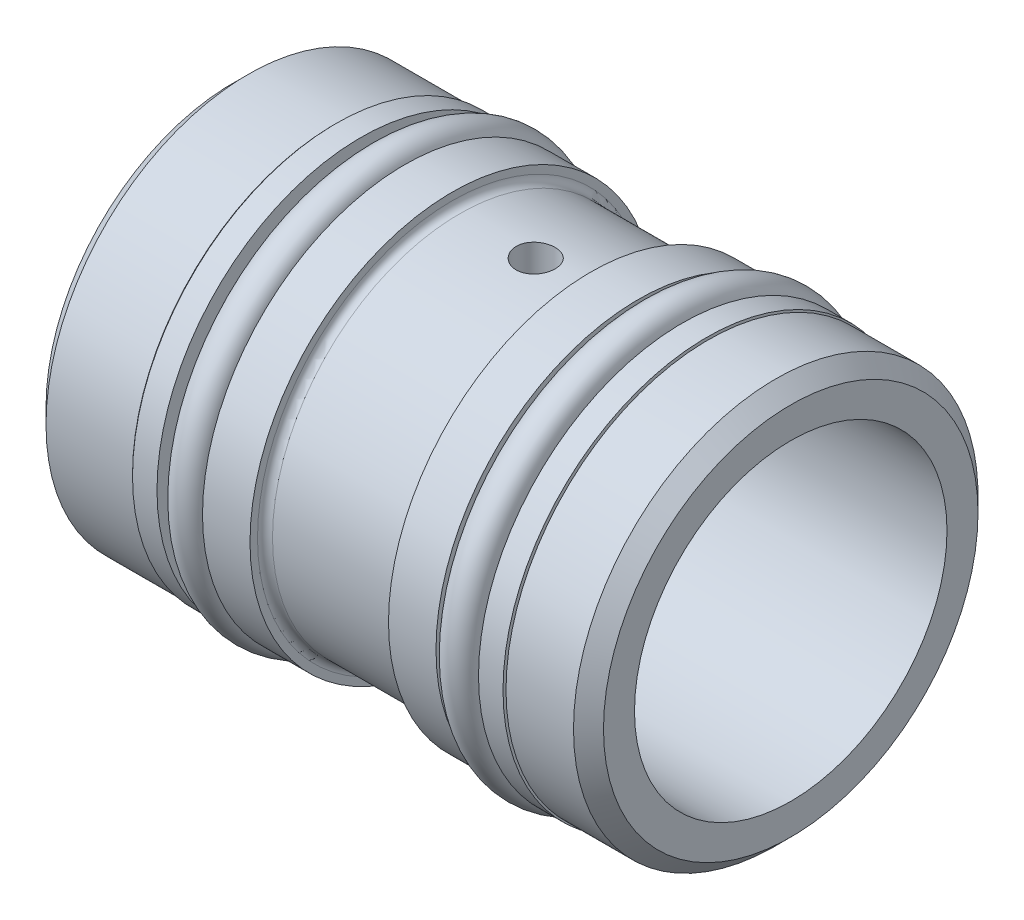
from build123d import *

# Parameters (mm, degrees)
FILLET1_R               = 0.381
CHAMFER1_SIZE           = 0.762
SKETCH6_R               = 0.889
SKETCH6_W               = 1.2446
SKETCH6_H               = 1.3462
CUT_EXTRUDE1_DEPTH      = 21.730675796
CUT_EXTRUDE1_DEPTH_BACK = 21.730675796
SKETCH7_R               = 0.9906


with BuildPart() as part:
    # Sketch1 → Revolve1 (revolve)
    with BuildSketch(Plane.XY, mode=Mode.PRIVATE) as revolve1_sk:
        Polygon((-14.1605, 4.7625), (-14.1605, 10.2743), (-9.0043, 10.2743), (-9.0043, 9.0043), (-5.4483, 9.0043), (-5.4483, 10.2743), (-3.0353, 10.2743), (-3.0353, 9.5123), (4.0005, 9.5123), (4.0005, 10.2743), (6.4135, 10.2743), (6.4135, 9.0043), (9.9695, 9.0043), (9.9695, 10.2743), (14.1605, 10.2743), (14.1605, 7.9375), (0.0889, 7.9375), (0.0889, 4.7625), align=None)
    revolve(revolve1_sk.sketch.rotate(Axis((0, 0, 0), (1, 0, 0)), 90), axis=Axis((0, 0, 0), (1, 0, 0)))

    # Fillet1
    fillet1_edges = [part.edges().sort_by_distance(p)[0] for p in [
        (-3.0353, 0, -9.5123),
        (4.0005, 0, -9.5123),
    ]]
    fillet(fillet1_edges, radius=FILLET1_R)

    # Chamfer1
    chamfer1_edges = [part.edges().sort_by_distance(p)[0] for p in [
        (-14.1605, 0, -10.2743),
        (14.1605, 0, -10.2743),
    ]]
    chamfer(chamfer1_edges, length=CHAMFER1_SIZE)

    # Sketch6 → Revolve3 (revolve)
    with BuildSketch(Plane.XY, mode=Mode.PRIVATE) as revolve3_sk:
        with Locations((-6.4135, 9.8171)):
            Circle(SKETCH6_R)
        with Locations((7.3787, 9.8171)):
            Circle(SKETCH6_R)
        with Locations((-8.3058, 9.6774)):
            Rectangle(SKETCH6_W, SKETCH6_H)
        with Locations((9.271, 9.6774)):
            Rectangle(SKETCH6_W, SKETCH6_H)
    revolve(revolve3_sk.sketch.rotate(Axis((0, 0, 0), (1, 0, 0)), 90), axis=Axis((0, 0, 0), (1, 0, 0)))

    # Sketch7 → Cut-Extrude1 (cut, two sides: drawn at the far end of the back side and taken through both)
    with BuildSketch(Plane(origin=(0, 0, 0), x_dir=(0, 0, -1), z_dir=(0, 1, 0)).offset(-CUT_EXTRUDE1_DEPTH_BACK)):
        with Locations(Location((0, -1.2065, 0), (0, 0, 180))):
            Circle(SKETCH7_R)
    extrude(amount=CUT_EXTRUDE1_DEPTH + CUT_EXTRUDE1_DEPTH_BACK, mode=Mode.SUBTRACT)


solid = part.part
